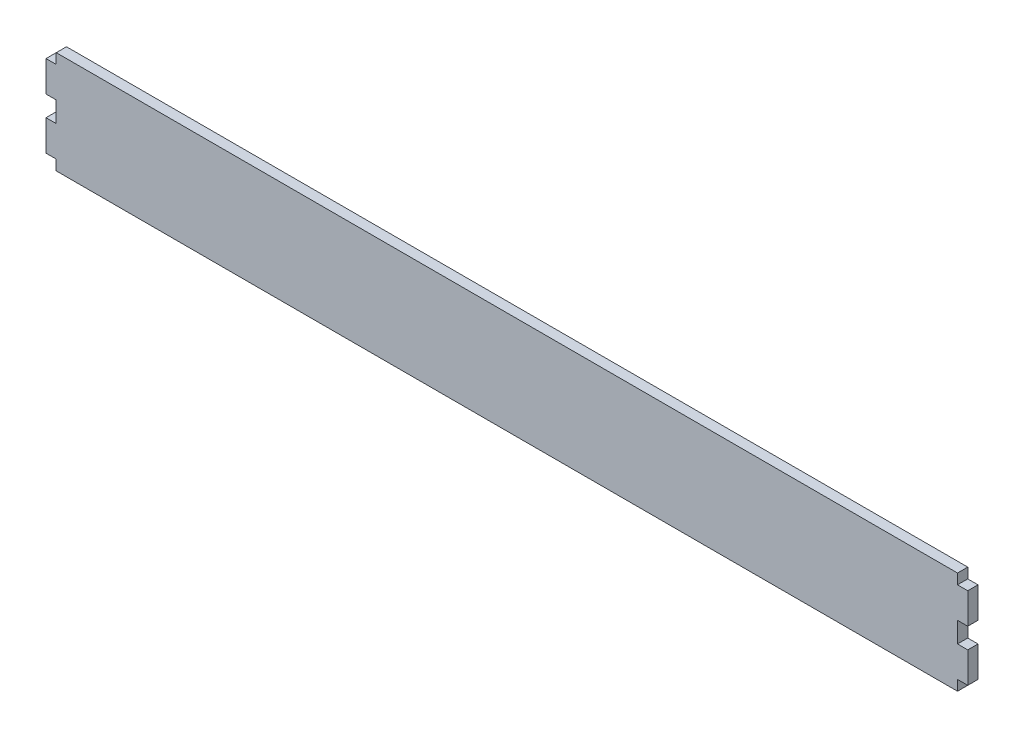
from build123d import *

# Parameters (mm, degrees)
BOSS_EXTRUDE1_DEPTH = 5


with BuildPart() as part:
    # Model → Boss-Extrude1 (new body)
    with BuildSketch(Plane.XY):
        Polygon((-220, -25), (220, -25), (220, -20), (225, -20), (225, -5), (220, -5), (220, 5), (225, 5), (225, 20), (220, 20), (220, 25), (-220, 25), (-220, 20), (-225, 20), (-225, 5), (-220, 5), (-220, -5), (-225, -5), (-225, -20), (-220, -20), align=None)
    extrude(amount=BOSS_EXTRUDE1_DEPTH)


solid = part.part
